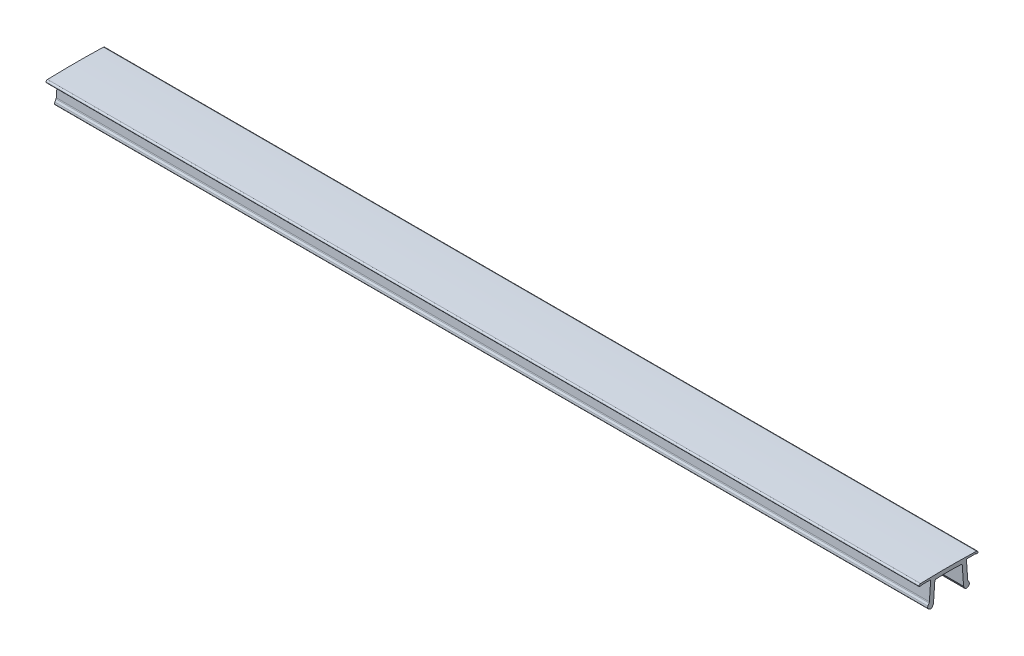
from build123d import *

# Parameters (mm, degrees)
PEITELISTAT_1_6003_PEITELISTA_GL_HARMAA_DEPTH = 200


with BuildPart() as part:
    # Sketch1 → Peitelistat 1.6003 PEITELISTA GL HARMAA (new body)
    with BuildSketch(Plane(origin=(0, 0, 0), x_dir=(0, 0, -1), z_dir=(1, 0, 0))):
        with BuildLine():
            Line((-6.356684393, 2.76813987), (-6.356684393, 2.72074575))
            ThreePointArc((-6.356684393, 2.72074575), (-6.327395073, 2.65003507), (-6.256684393, 2.62074575))
            Line((-6.256684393, 2.62074575), (-5.956684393, 2.62074575))
            ThreePointArc((-5.956684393, 2.62074575), (-5.906684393, 2.634143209), (-5.870081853, 2.67074575))
            ThreePointArc((-5.870081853, 2.67074575), (-5.833479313, 2.70734829), (-5.783479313, 2.72074575))
            Line((-5.783479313, 2.72074575), (-3.806928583, 2.72074575))
            ThreePointArc((-3.806928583, 2.72074575), (-3.733793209, 2.688945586), (-3.707172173, 2.6137701))
            Line((-3.707172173, 2.6137701), (-3.996229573, -1.51994333))
            ThreePointArc((-3.996229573, -1.51994333), (-4.016859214, -1.631250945), (-4.061998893, -1.73506509))
            Line((-4.061998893, -1.73506509), (-4.328166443, -2.19608081))
            ThreePointArc((-4.328166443, -2.19608081), (-4.372012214, -2.596433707), (-4.106462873, -2.8992347))
            Line((-4.106462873, -2.8992347), (-3.758413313, -3.06153288))
            ThreePointArc((-3.758413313, -3.06153288), (-3.541416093, -3.07575563), (-3.371820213, -2.93964054))
            Line((-3.371820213, -2.93964054), (-3.089277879, -2.450262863))
            ThreePointArc((-3.089277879, -2.450262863), (-3.062194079, -2.387974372), (-3.049816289, -2.321189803))
            Line((-3.049816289, -2.321189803), (-2.750431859, 1.960206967))
            ThreePointArc((-2.750431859, 1.960206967), (-2.661959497, 2.152738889), (-2.468332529, 2.238788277))
            ThreePointArc((-2.468332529, 2.238788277), (0.393315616, 2.320745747), (3.254963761, 2.238788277))
            ThreePointArc((3.254963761, 2.238788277), (3.448590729, 2.152738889), (3.537063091, 1.960206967))
            Line((3.537063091, 1.960206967), (3.836447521, -2.321189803))
            ThreePointArc((3.836447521, -2.321189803), (3.848825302, -2.387974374), (3.875909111, -2.450262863))
            Line((3.875909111, -2.450262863), (4.158451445, -2.93964054))
            ThreePointArc((4.158451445, -2.93964054), (4.328047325, -3.07575563), (4.545044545, -3.06153288))
            Line((4.545044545, -3.06153288), (4.893094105, -2.8992347))
            ThreePointArc((4.893094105, -2.8992347), (5.158643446, -2.596433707), (5.114797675, -2.19608081))
            Line((5.114797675, -2.19608081), (4.848630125, -1.73506509))
            ThreePointArc((4.848630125, -1.73506509), (4.803490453, -1.631250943), (4.782860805, -1.51994333))
            Line((4.782860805, -1.51994333), (4.493803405, 2.6137701))
            ThreePointArc((4.493803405, 2.6137701), (4.520424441, 2.688945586), (4.593559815, 2.72074575))
            Line((4.593559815, 2.72074575), (6.570110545, 2.72074575))
            ThreePointArc((6.570110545, 2.72074575), (6.620110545, 2.70734829), (6.656713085, 2.67074575))
            ThreePointArc((6.656713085, 2.67074575), (6.693315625, 2.634143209), (6.743315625, 2.62074575))
            Line((6.743315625, 2.62074575), (7.043315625, 2.62074575))
            ThreePointArc((7.043315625, 2.62074575), (7.1140263, 2.650035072), (7.143315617, 2.72074575))
            Line((7.143315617, 2.72074575), (7.143315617, 2.76813987))
            ThreePointArc((7.143315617, 2.76813987), (7.044738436, 3.011628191), (6.804535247, 3.11795999))
            ThreePointArc((6.804535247, 3.11795999), (0.393315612, 3.22074575), (-6.017904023, 3.11795999))
            ThreePointArc((-6.017904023, 3.11795999), (-6.258107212, 3.011628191), (-6.356684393, 2.76813987))
        make_face()
    extrude(amount=PEITELISTAT_1_6003_PEITELISTA_GL_HARMAA_DEPTH)


solid = part.part
